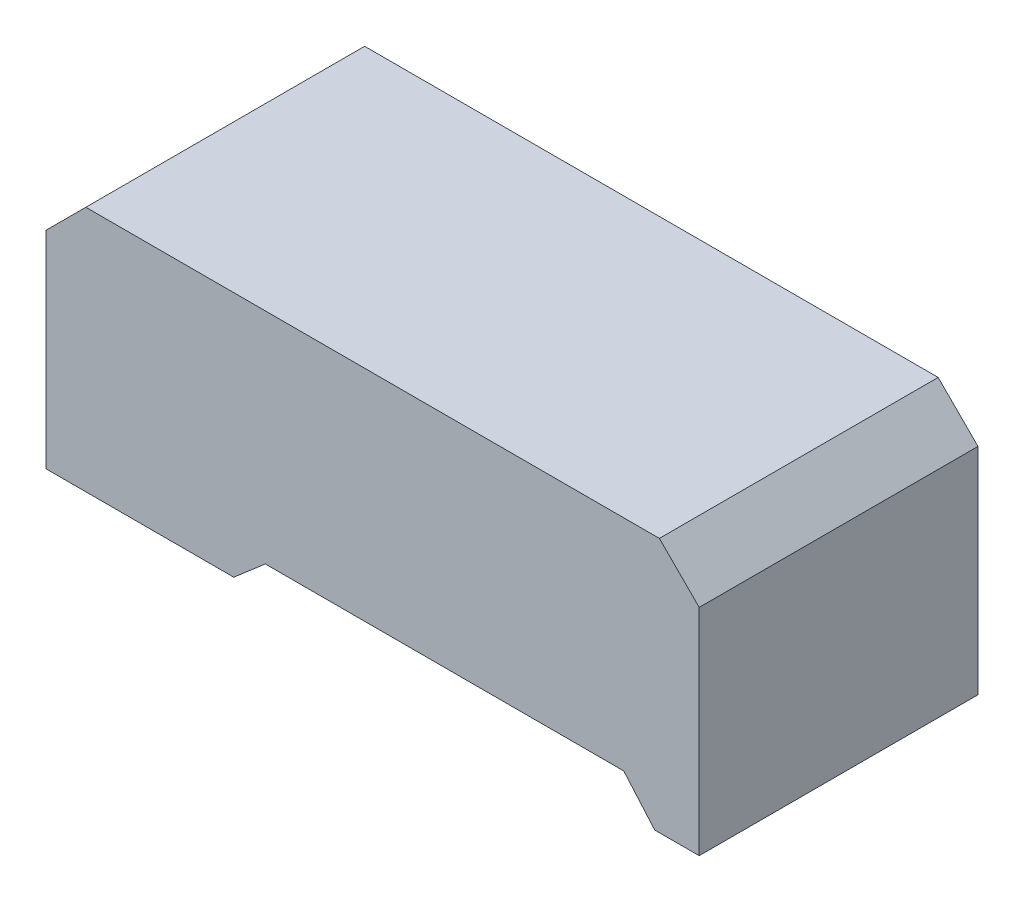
ISO-10303-21;
HEADER;
FILE_DESCRIPTION(('STEP AP214'),'2;1');
FILE_NAME('part.step','',(''),(''),'','','');
FILE_SCHEMA(('AUTOMOTIVE_DESIGN { 1 0 10303 214 1 1 1 1 }'));
ENDSEC;
DATA;
#1=APPLICATION_CONTEXT('core data for automotive mechanical design processes');
#2=APPLICATION_PROTOCOL_DEFINITION('international standard','automotive_design',2000,#1);
#3=PRODUCT_CONTEXT('',#1,'mechanical');
#4=PRODUCT('Part','Part','',(#3));
#5=PRODUCT_RELATED_PRODUCT_CATEGORY('part','',(#4));
#6=PRODUCT_DEFINITION_FORMATION('','',#4);
#7=PRODUCT_DEFINITION_CONTEXT('part definition',#1,'design');
#8=PRODUCT_DEFINITION('design','',#6,#7);
#9=PRODUCT_DEFINITION_SHAPE('','',#8);
#10=(LENGTH_UNIT() NAMED_UNIT(*) SI_UNIT(.MILLI.,.METRE.));
#11=(NAMED_UNIT(*) PLANE_ANGLE_UNIT() SI_UNIT($,.RADIAN.));
#12=(NAMED_UNIT(*) SI_UNIT($,.STERADIAN.) SOLID_ANGLE_UNIT());
#13=UNCERTAINTY_MEASURE_WITH_UNIT(LENGTH_MEASURE(1.E-05),#10,'distance_accuracy_value','');
#14=(GEOMETRIC_REPRESENTATION_CONTEXT(3) GLOBAL_UNCERTAINTY_ASSIGNED_CONTEXT((#13)) GLOBAL_UNIT_ASSIGNED_CONTEXT((#10,
#11,#12)) REPRESENTATION_CONTEXT('',''));
#15=CARTESIAN_POINT('',(0.,0.,0.));
#16=DIRECTION('',(0.,0.,1.));
#17=DIRECTION('',(1.,0.,0.));
#18=AXIS2_PLACEMENT_3D('',#15,#16,#17);
#19=CARTESIAN_POINT('',(-86.7445201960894,11.7984950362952,35.));
#20=DIRECTION('',(1.,0.,0.));
#21=DIRECTION('',(0.,0.,-1.));
#22=AXIS2_PLACEMENT_3D('',#19,#20,#21);
#23=PLANE('',#22);
#24=DIRECTION('',(0.,-1.,0.));
#25=VECTOR('',#24,1.);
#26=CARTESIAN_POINT('',(-86.7445201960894,11.7984950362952,35.));
#27=LINE('',#26,#25);
#28=CARTESIAN_POINT('',(-86.7445201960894,6.79849503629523,35.));
#29=VERTEX_POINT('',#28);
#30=CARTESIAN_POINT('',(-86.7445201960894,-19.1376344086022,35.));
#31=VERTEX_POINT('',#30);
#32=EDGE_CURVE('E149',#29,#31,#27,.T.);
#33=ORIENTED_EDGE('',*,*,#32,.F.);
#34=DIRECTION('',(0.,0.,-1.));
#35=VECTOR('',#34,1.);
#36=CARTESIAN_POINT('',(-86.7445201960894,6.79849503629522,35.));
#37=LINE('',#36,#35);
#38=CARTESIAN_POINT('',(-86.7445201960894,6.79849503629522,0.));
#39=VERTEX_POINT('',#38);
#40=EDGE_CURVE('E115',#29,#39,#37,.T.);
#41=ORIENTED_EDGE('',*,*,#40,.T.);
#42=DIRECTION('',(0.,-1.,0.));
#43=VECTOR('',#42,1.);
#44=CARTESIAN_POINT('',(-86.7445201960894,11.7984950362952,0.));
#45=LINE('',#44,#43);
#46=CARTESIAN_POINT('',(-86.7445201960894,-19.1376344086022,0.));
#47=VERTEX_POINT('',#46);
#48=EDGE_CURVE('E109',#39,#47,#45,.T.);
#49=ORIENTED_EDGE('',*,*,#48,.T.);
#50=DIRECTION('',(0.,0.,-1.));
#51=VECTOR('',#50,1.);
#52=CARTESIAN_POINT('',(-86.7445201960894,-19.1376344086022,35.));
#53=LINE('',#52,#51);
#54=EDGE_CURVE('E113',#31,#47,#53,.T.);
#55=ORIENTED_EDGE('',*,*,#54,.F.);
#56=EDGE_LOOP('',(#33,#41,#49,#55));
#57=FACE_BOUND('',#56,.T.);
#58=ADVANCED_FACE('F30',(#57),#23,.F.);
#59=CARTESIAN_POINT('',(-86.7445201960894,-19.1376344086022,35.));
#60=DIRECTION('',(0.,1.,0.));
#61=DIRECTION('',(0.,0.,1.));
#62=AXIS2_PLACEMENT_3D('',#59,#60,#61);
#63=PLANE('',#62);
#64=DIRECTION('',(1.,0.,0.));
#65=VECTOR('',#64,1.);
#66=CARTESIAN_POINT('',(-86.7445201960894,-19.1376344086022,0.));
#67=LINE('',#66,#65);
#68=CARTESIAN_POINT('',(-63.1750989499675,-19.1376344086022,0.));
#69=VERTEX_POINT('',#68);
#70=EDGE_CURVE('E117',#47,#69,#67,.T.);
#71=ORIENTED_EDGE('',*,*,#70,.T.);
#72=DIRECTION('',(0.,0.,-1.));
#73=VECTOR('',#72,1.);
#74=CARTESIAN_POINT('',(-63.1750989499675,-19.1376344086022,35.));
#75=LINE('',#74,#73);
#76=CARTESIAN_POINT('',(-63.1750989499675,-19.1376344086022,35.));
#77=VERTEX_POINT('',#76);
#78=EDGE_CURVE('E130',#77,#69,#75,.T.);
#79=ORIENTED_EDGE('',*,*,#78,.F.);
#80=DIRECTION('',(1.,0.,0.));
#81=VECTOR('',#80,1.);
#82=CARTESIAN_POINT('',(-86.7445201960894,-19.1376344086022,35.));
#83=LINE('',#82,#81);
#84=EDGE_CURVE('E129',#31,#77,#83,.T.);
#85=ORIENTED_EDGE('',*,*,#84,.F.);
#86=ORIENTED_EDGE('',*,*,#54,.T.);
#87=EDGE_LOOP('',(#71,#79,#85,#86));
#88=FACE_BOUND('',#87,.T.);
#89=ADVANCED_FACE('F128',(#88),#63,.F.);
#90=CARTESIAN_POINT('',(-63.1750989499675,-19.1376344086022,35.));
#91=DIRECTION('',(-0.653546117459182,0.756886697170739,0.));
#92=DIRECTION('',(-0.756886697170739,-0.653546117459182,0.));
#93=AXIS2_PLACEMENT_3D('',#90,#91,#92);
#94=PLANE('',#93);
#95=DIRECTION('',(0.756886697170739,0.653546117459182,0.));
#96=VECTOR('',#95,1.);
#97=CARTESIAN_POINT('',(-63.1750989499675,-19.1376344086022,0.));
#98=LINE('',#97,#96);
#99=CARTESIAN_POINT('',(-59.2156476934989,-15.7187818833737,0.));
#100=VERTEX_POINT('',#99);
#101=EDGE_CURVE('E122',#69,#100,#98,.T.);
#102=ORIENTED_EDGE('',*,*,#101,.T.);
#103=DIRECTION('',(0.,0.,-1.));
#104=VECTOR('',#103,1.);
#105=CARTESIAN_POINT('',(-59.2156476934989,-15.7187818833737,35.));
#106=LINE('',#105,#104);
#107=CARTESIAN_POINT('',(-59.2156476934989,-15.7187818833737,35.));
#108=VERTEX_POINT('',#107);
#109=EDGE_CURVE('E134',#108,#100,#106,.T.);
#110=ORIENTED_EDGE('',*,*,#109,.F.);
#111=DIRECTION('',(0.756886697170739,0.653546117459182,0.));
#112=VECTOR('',#111,1.);
#113=CARTESIAN_POINT('',(-63.1750989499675,-19.1376344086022,35.));
#114=LINE('',#113,#112);
#115=EDGE_CURVE('E165',#77,#108,#114,.T.);
#116=ORIENTED_EDGE('',*,*,#115,.F.);
#117=ORIENTED_EDGE('',*,*,#78,.T.);
#118=EDGE_LOOP('',(#102,#110,#116,#117));
#119=FACE_BOUND('',#118,.T.);
#120=ADVANCED_FACE('F219',(#119),#94,.F.);
#121=CARTESIAN_POINT('',(-59.2156476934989,-15.7187818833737,35.));
#122=DIRECTION('',(0.,1.,0.));
#123=DIRECTION('',(0.,0.,1.));
#124=AXIS2_PLACEMENT_3D('',#121,#122,#123);
#125=PLANE('',#124);
#126=DIRECTION('',(1.,0.,0.));
#127=VECTOR('',#126,1.);
#128=CARTESIAN_POINT('',(-59.2156476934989,-15.7187818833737,0.));
#129=LINE('',#128,#127);
#130=CARTESIAN_POINT('',(-14.2156476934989,-15.7187818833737,0.));
#131=VERTEX_POINT('',#130);
#132=EDGE_CURVE('E190',#100,#131,#129,.T.);
#133=ORIENTED_EDGE('',*,*,#132,.T.);
#134=DIRECTION('',(0.,0.,-1.));
#135=VECTOR('',#134,1.);
#136=CARTESIAN_POINT('',(-14.2156476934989,-15.7187818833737,35.));
#137=LINE('',#136,#135);
#138=CARTESIAN_POINT('',(-14.2156476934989,-15.7187818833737,35.));
#139=VERTEX_POINT('',#138);
#140=EDGE_CURVE('E182',#139,#131,#137,.T.);
#141=ORIENTED_EDGE('',*,*,#140,.F.);
#142=DIRECTION('',(1.,0.,0.));
#143=VECTOR('',#142,1.);
#144=CARTESIAN_POINT('',(-59.2156476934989,-15.7187818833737,35.));
#145=LINE('',#144,#143);
#146=EDGE_CURVE('E167',#108,#139,#145,.T.);
#147=ORIENTED_EDGE('',*,*,#146,.F.);
#148=ORIENTED_EDGE('',*,*,#109,.T.);
#149=EDGE_LOOP('',(#133,#141,#147,#148));
#150=FACE_BOUND('',#149,.T.);
#151=ADVANCED_FACE('F188',(#150),#125,.F.);
#152=CARTESIAN_POINT('',(-14.2156476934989,-15.7187818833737,35.));
#153=DIRECTION('',(0.755906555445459,0.654679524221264,0.));
#154=DIRECTION('',(-0.654679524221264,0.755906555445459,0.));
#155=AXIS2_PLACEMENT_3D('',#152,#153,#154);
#156=PLANE('',#155);
#157=DIRECTION('',(0.654679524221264,-0.755906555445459,0.));
#158=VECTOR('',#157,1.);
#159=CARTESIAN_POINT('',(-14.2156476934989,-15.7187818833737,0.));
#160=LINE('',#159,#158);
#161=CARTESIAN_POINT('',(-10.3332273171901,-20.2015049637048,0.));
#162=VERTEX_POINT('',#161);
#163=EDGE_CURVE('E195',#131,#162,#160,.T.);
#164=ORIENTED_EDGE('',*,*,#163,.T.);
#165=DIRECTION('',(0.,0.,-1.));
#166=VECTOR('',#165,1.);
#167=CARTESIAN_POINT('',(-10.3332273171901,-20.2015049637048,35.));
#168=LINE('',#167,#166);
#169=CARTESIAN_POINT('',(-10.3332273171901,-20.2015049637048,35.));
#170=VERTEX_POINT('',#169);
#171=EDGE_CURVE('E179',#170,#162,#168,.T.);
#172=ORIENTED_EDGE('',*,*,#171,.F.);
#173=DIRECTION('',(0.654679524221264,-0.755906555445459,0.));
#174=VECTOR('',#173,1.);
#175=CARTESIAN_POINT('',(-14.2156476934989,-15.7187818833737,35.));
#176=LINE('',#175,#174);
#177=EDGE_CURVE('E169',#139,#170,#176,.T.);
#178=ORIENTED_EDGE('',*,*,#177,.F.);
#179=ORIENTED_EDGE('',*,*,#140,.T.);
#180=EDGE_LOOP('',(#164,#172,#178,#179));
#181=FACE_BOUND('',#180,.T.);
#182=ADVANCED_FACE('F211',(#181),#156,.F.);
#183=CARTESIAN_POINT('',(-10.3332273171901,-20.2015049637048,35.));
#184=DIRECTION('',(0.,1.,0.));
#185=DIRECTION('',(0.,0.,1.));
#186=AXIS2_PLACEMENT_3D('',#183,#184,#185);
#187=PLANE('',#186);
#188=DIRECTION('',(1.,0.,0.));
#189=VECTOR('',#188,1.);
#190=CARTESIAN_POINT('',(-10.3332273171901,-20.2015049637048,0.));
#191=LINE('',#190,#189);
#192=CARTESIAN_POINT('',(-4.7445201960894,-20.2015049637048,0.));
#193=VERTEX_POINT('',#192);
#194=EDGE_CURVE('E160',#162,#193,#191,.T.);
#195=ORIENTED_EDGE('',*,*,#194,.T.);
#196=DIRECTION('',(0.,0.,-1.));
#197=VECTOR('',#196,1.);
#198=CARTESIAN_POINT('',(-4.7445201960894,-20.2015049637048,35.));
#199=LINE('',#198,#197);
#200=CARTESIAN_POINT('',(-4.7445201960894,-20.2015049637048,35.));
#201=VERTEX_POINT('',#200);
#202=EDGE_CURVE('E176',#201,#193,#199,.T.);
#203=ORIENTED_EDGE('',*,*,#202,.F.);
#204=DIRECTION('',(1.,0.,0.));
#205=VECTOR('',#204,1.);
#206=CARTESIAN_POINT('',(-10.3332273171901,-20.2015049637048,35.));
#207=LINE('',#206,#205);
#208=EDGE_CURVE('E171',#170,#201,#207,.T.);
#209=ORIENTED_EDGE('',*,*,#208,.F.);
#210=ORIENTED_EDGE('',*,*,#171,.T.);
#211=EDGE_LOOP('',(#195,#203,#209,#210));
#212=FACE_BOUND('',#211,.T.);
#213=ADVANCED_FACE('F201',(#212),#187,.F.);
#214=CARTESIAN_POINT('',(-4.7445201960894,-20.2015049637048,35.));
#215=DIRECTION('',(-1.,0.,0.));
#216=DIRECTION('',(0.,0.,1.));
#217=AXIS2_PLACEMENT_3D('',#214,#215,#216);
#218=PLANE('',#217);
#219=DIRECTION('',(0.,1.,0.));
#220=VECTOR('',#219,1.);
#221=CARTESIAN_POINT('',(-4.7445201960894,-20.2015049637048,0.));
#222=LINE('',#221,#220);
#223=CARTESIAN_POINT('',(-4.7445201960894,6.79849503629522,0.));
#224=VERTEX_POINT('',#223);
#225=EDGE_CURVE('E158',#193,#224,#222,.T.);
#226=ORIENTED_EDGE('',*,*,#225,.T.);
#227=DIRECTION('',(0.,0.,1.));
#228=VECTOR('',#227,1.);
#229=CARTESIAN_POINT('',(-4.7445201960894,6.79849503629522,35.));
#230=LINE('',#229,#228);
#231=CARTESIAN_POINT('',(-4.74452019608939,6.79849503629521,35.));
#232=VERTEX_POINT('',#231);
#233=EDGE_CURVE('E11',#224,#232,#230,.T.);
#234=ORIENTED_EDGE('',*,*,#233,.T.);
#235=DIRECTION('',(0.,1.,0.));
#236=VECTOR('',#235,1.);
#237=CARTESIAN_POINT('',(-4.7445201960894,-20.2015049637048,35.));
#238=LINE('',#237,#236);
#239=EDGE_CURVE('E173',#201,#232,#238,.T.);
#240=ORIENTED_EDGE('',*,*,#239,.F.);
#241=ORIENTED_EDGE('',*,*,#202,.T.);
#242=EDGE_LOOP('',(#226,#234,#240,#241));
#243=FACE_BOUND('',#242,.T.);
#244=ADVANCED_FACE('F205',(#243),#218,.F.);
#245=CARTESIAN_POINT('',(-4.7445201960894,11.7984950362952,35.));
#246=DIRECTION('',(0.,-1.,0.));
#247=DIRECTION('',(1.,0.,0.));
#248=AXIS2_PLACEMENT_3D('',#245,#246,#247);
#249=PLANE('',#248);
#250=DIRECTION('',(-1.,0.,0.));
#251=VECTOR('',#250,1.);
#252=CARTESIAN_POINT('',(-4.7445201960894,11.7984950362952,0.));
#253=LINE('',#252,#251);
#254=CARTESIAN_POINT('',(-9.7445201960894,11.7984950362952,0.));
#255=VERTEX_POINT('',#254);
#256=CARTESIAN_POINT('',(-81.7445201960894,11.7984950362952,0.));
#257=VERTEX_POINT('',#256);
#258=EDGE_CURVE('E152',#255,#257,#253,.T.);
#259=ORIENTED_EDGE('',*,*,#258,.T.);
#260=DIRECTION('',(0.,0.,1.));
#261=VECTOR('',#260,1.);
#262=CARTESIAN_POINT('',(-81.7445201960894,11.7984950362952,35.));
#263=LINE('',#262,#261);
#264=CARTESIAN_POINT('',(-81.7445201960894,11.7984950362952,35.));
#265=VERTEX_POINT('',#264);
#266=EDGE_CURVE('E50',#257,#265,#263,.T.);
#267=ORIENTED_EDGE('',*,*,#266,.T.);
#268=DIRECTION('',(-1.,0.,0.));
#269=VECTOR('',#268,1.);
#270=CARTESIAN_POINT('',(-4.7445201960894,11.7984950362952,35.));
#271=LINE('',#270,#269);
#272=CARTESIAN_POINT('',(-9.74452019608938,11.7984950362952,35.));
#273=VERTEX_POINT('',#272);
#274=EDGE_CURVE('E150',#273,#265,#271,.T.);
#275=ORIENTED_EDGE('',*,*,#274,.F.);
#276=DIRECTION('',(0.,0.,-1.));
#277=VECTOR('',#276,1.);
#278=CARTESIAN_POINT('',(-9.7445201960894,11.7984950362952,35.));
#279=LINE('',#278,#277);
#280=EDGE_CURVE('E141',#273,#255,#279,.T.);
#281=ORIENTED_EDGE('',*,*,#280,.T.);
#282=EDGE_LOOP('',(#259,#267,#275,#281));
#283=FACE_BOUND('',#282,.T.);
#284=ADVANCED_FACE('F156',(#283),#249,.F.);
#285=CARTESIAN_POINT('',(-86.7445201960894,-19.1376344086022,35.));
#286=DIRECTION('',(0.,0.,1.));
#287=DIRECTION('',(1.,0.,0.));
#288=AXIS2_PLACEMENT_3D('',#285,#286,#287);
#289=PLANE('',#288);
#290=ORIENTED_EDGE('',*,*,#274,.T.);
#291=DIRECTION('',(0.707106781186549,0.707106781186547,0.));
#292=VECTOR('',#291,1.);
#293=CARTESIAN_POINT('',(-99.7125849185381,-6.16956968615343,35.));
#294=LINE('',#293,#292);
#295=EDGE_CURVE('E37',#265,#29,#294,.F.);
#296=ORIENTED_EDGE('',*,*,#295,.T.);
#297=ORIENTED_EDGE('',*,*,#32,.T.);
#298=ORIENTED_EDGE('',*,*,#84,.T.);
#299=ORIENTED_EDGE('',*,*,#115,.T.);
#300=ORIENTED_EDGE('',*,*,#146,.T.);
#301=ORIENTED_EDGE('',*,*,#177,.T.);
#302=ORIENTED_EDGE('',*,*,#208,.T.);
#303=ORIENTED_EDGE('',*,*,#239,.T.);
#304=DIRECTION('',(0.707106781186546,-0.707106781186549,0.));
#305=VECTOR('',#304,1.);
#306=CARTESIAN_POINT('',(-32.7764554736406,34.8304303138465,35.));
#307=LINE('',#306,#305);
#308=EDGE_CURVE('E145',#232,#273,#307,.F.);
#309=ORIENTED_EDGE('',*,*,#308,.T.);
#310=EDGE_LOOP('',(#290,#296,#297,#298,#299,#300,#301,#302,#303,#309));
#311=FACE_BOUND('',#310,.T.);
#312=ADVANCED_FACE('F148',(#311),#289,.T.);
#313=CARTESIAN_POINT('',(-86.7445201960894,-19.1376344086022,0.));
#314=DIRECTION('',(0.,0.,1.));
#315=DIRECTION('',(1.,0.,0.));
#316=AXIS2_PLACEMENT_3D('',#313,#314,#315);
#317=PLANE('',#316);
#318=ORIENTED_EDGE('',*,*,#48,.F.);
#319=DIRECTION('',(-0.707106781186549,-0.707106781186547,0.));
#320=VECTOR('',#319,1.);
#321=CARTESIAN_POINT('',(-86.7445201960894,6.79849503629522,0.));
#322=LINE('',#321,#320);
#323=EDGE_CURVE('E139',#39,#257,#322,.F.);
#324=ORIENTED_EDGE('',*,*,#323,.T.);
#325=ORIENTED_EDGE('',*,*,#258,.F.);
#326=DIRECTION('',(-0.707106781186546,0.707106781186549,0.));
#327=VECTOR('',#326,1.);
#328=CARTESIAN_POINT('',(-9.7445201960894,11.7984950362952,0.));
#329=LINE('',#328,#327);
#330=EDGE_CURVE('E132',#255,#224,#329,.F.);
#331=ORIENTED_EDGE('',*,*,#330,.T.);
#332=ORIENTED_EDGE('',*,*,#225,.F.);
#333=ORIENTED_EDGE('',*,*,#194,.F.);
#334=ORIENTED_EDGE('',*,*,#163,.F.);
#335=ORIENTED_EDGE('',*,*,#132,.F.);
#336=ORIENTED_EDGE('',*,*,#101,.F.);
#337=ORIENTED_EDGE('',*,*,#70,.F.);
#338=EDGE_LOOP('',(#318,#324,#325,#331,#332,#333,#334,#335,#336,#337));
#339=FACE_BOUND('',#338,.T.);
#340=ADVANCED_FACE('F120',(#339),#317,.F.);
#341=CARTESIAN_POINT('',(-86.7445201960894,6.79849503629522,35.));
#342=DIRECTION('',(0.707106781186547,-0.707106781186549,0.));
#343=DIRECTION('',(0.707106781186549,0.707106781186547,0.));
#344=AXIS2_PLACEMENT_3D('',#341,#342,#343);
#345=PLANE('',#344);
#346=ORIENTED_EDGE('',*,*,#295,.F.);
#347=ORIENTED_EDGE('',*,*,#266,.F.);
#348=ORIENTED_EDGE('',*,*,#323,.F.);
#349=ORIENTED_EDGE('',*,*,#40,.F.);
#350=EDGE_LOOP('',(#346,#347,#348,#349));
#351=FACE_BOUND('',#350,.T.);
#352=ADVANCED_FACE('F154',(#351),#345,.F.);
#353=CARTESIAN_POINT('',(-9.7445201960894,11.7984950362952,35.));
#354=DIRECTION('',(-0.707106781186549,-0.707106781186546,0.));
#355=DIRECTION('',(0.707106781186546,-0.707106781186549,0.));
#356=AXIS2_PLACEMENT_3D('',#353,#354,#355);
#357=PLANE('',#356);
#358=ORIENTED_EDGE('',*,*,#308,.F.);
#359=ORIENTED_EDGE('',*,*,#233,.F.);
#360=ORIENTED_EDGE('',*,*,#330,.F.);
#361=ORIENTED_EDGE('',*,*,#280,.F.);
#362=EDGE_LOOP('',(#358,#359,#360,#361));
#363=FACE_BOUND('',#362,.T.);
#364=ADVANCED_FACE('F208',(#363),#357,.F.);
#365=CLOSED_SHELL('',(#58,#89,#120,#151,#182,#213,#244,#284,#312,#340,#352,#364));
#366=MANIFOLD_SOLID_BREP('B2',#365);
#367=ADVANCED_BREP_SHAPE_REPRESENTATION('',(#18,#366),#14);
#368=SHAPE_DEFINITION_REPRESENTATION(#9,#367);
ENDSEC;
END-ISO-10303-21;
